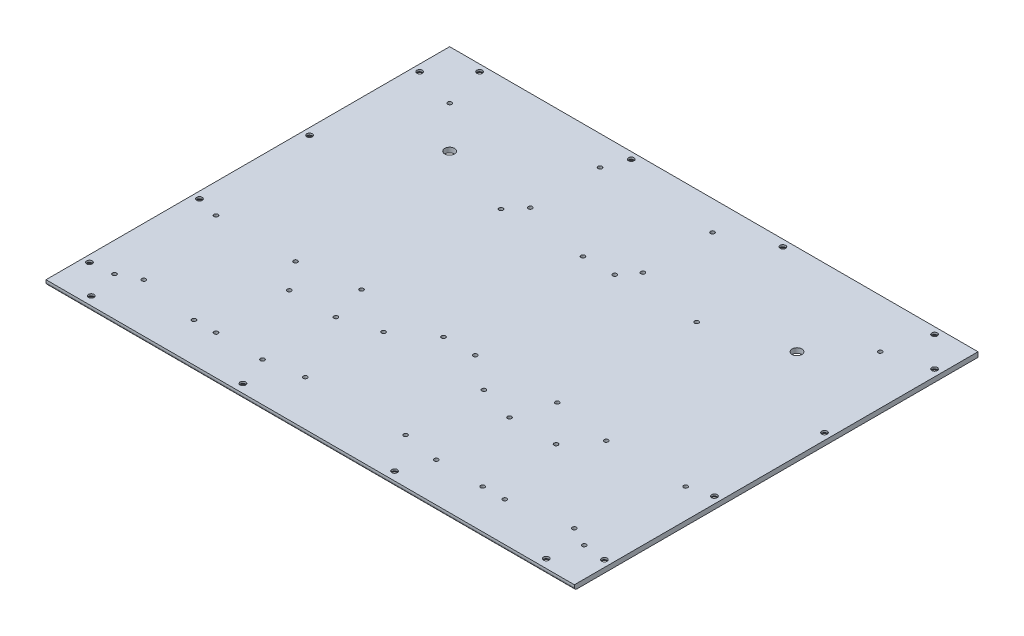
from build123d import *

# Parameters (mm, degrees)
SKETCH_2_W                   = 432
SKETCH_2_H                   = 330
EXTRUDE_1_DEPTH              = 4
HOLE_WIZARD_406_AT_2_COUNT   = 2
HOLE_WIZARD_406_AT_2_PITCH   = 294.02253315
HOLE_WIZARD_406_AT_3_COUNT   = 2
HOLE_WIZARD_406_AT_3_PITCH   = 204.473103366
HOLE_WIZARD_406_AT_4_COUNT   = 2
HOLE_WIZARD_406_AT_4_PITCH   = 115.625472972
HOLE_WIZARD_406_AT_5_COUNT   = 2
HOLE_WIZARD_406_AT_5_PITCH   = 33.604315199
HOLE_WIZARD_406_AT_6_COUNT   = 2
HOLE_WIZARD_406_AT_6_PITCH   = 124
HOLE_WIZARD_406_AT_7_COUNT   = 2
HOLE_WIZARD_406_AT_7_PITCH   = 248
HOLE_WIZARD_406_AT_8_COUNT   = 2
HOLE_WIZARD_406_AT_8_PITCH   = 372
HOLE_WIZARD_406_AT_9_COUNT   = 2
HOLE_WIZARD_406_AT_9_PITCH   = 397.166526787
HOLE_WIZARD_406_AT_10_COUNT  = 2
HOLE_WIZARD_406_AT_10_PITCH  = 412.28782422
HOLE_WIZARD_406_AT_11_COUNT  = 2
HOLE_WIZARD_406_AT_11_PITCH  = 445.445002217
HOLE_WIZARD_406_AT_12_COUNT  = 2
HOLE_WIZARD_406_AT_12_PITCH  = 493.012423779
HOLE_WIZARD_406_AT_13_COUNT  = 2
HOLE_WIZARD_406_AT_13_PITCH  = 489.070802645
HOLE_WIZARD_406_AT_14_COUNT  = 2
HOLE_WIZARD_406_AT_14_PITCH  = 402.87746276
HOLE_WIZARD_406_AT_15_COUNT  = 2
HOLE_WIZARD_406_AT_15_PITCH  = 340.855174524
HOLE_WIZARD_406_AT_16_COUNT  = 2
HOLE_WIZARD_406_AT_16_PITCH  = 317.5
FILLET_1_R                   = 2
HOLE_WIZARD_1584_D           = 8
M4P8_D                       = 3.3
HOLE_WIZARD_3528_D           = 3.3
HOLE_WIZARD_3528_CSINK_D     = 4.05
HOLE_WIZARD_3528_CSINK_ANGLE = 90
M4P9_D                       = 3.3
M4P10_D                      = 3.3


with BuildPart() as part:
    # Sketch 2 → Extrude 1 (new body)
    with BuildSketch(Plane(origin=(0, 0, 0), x_dir=(1, 0, 0), z_dir=(0, 1, 0))):
        with Locations((216, 165)):
            Rectangle(SKETCH_2_W, SKETCH_2_H)
    extrude(amount=EXTRUDE_1_DEPTH)

    # Sketch 3 → Hole Wizard 406 (revolve, cut)
    with BuildSketch(Plane(origin=(30, 0, -7), x_dir=(0, 0, -1), z_dir=(1, 0, 0))):
        Polygon((0, 0), (0, 4), (2.25, 4), (2.25, 2.45), (4.7, 0), align=None)
    hole_wizard_406 = revolve(axis=Axis((30, -6.35, -7), (0, 1, 0)), mode=Mode.SUBTRACT)

    # Hole Wizard 406 at 2: Hole Wizard 406 ×2
    with Locations(*[Vector(-0.0833269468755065, 0, -0.9965222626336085) * (i * HOLE_WIZARD_406_AT_2_PITCH) for i in range(1, HOLE_WIZARD_406_AT_2_COUNT)]):
        add(hole_wizard_406, mode=Mode.SUBTRACT)

    # Hole Wizard 406 at 3: Hole Wizard 406 ×2
    with Locations(*[Vector(-0.11982016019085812, 0, -0.9927956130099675) * (i * HOLE_WIZARD_406_AT_3_PITCH) for i in range(1, HOLE_WIZARD_406_AT_3_COUNT)]):
        add(hole_wizard_406, mode=Mode.SUBTRACT)

    # Hole Wizard 406 at 4: Hole Wizard 406 ×2
    with Locations(*[Vector(-0.21189102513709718, 0, -0.977293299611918) * (i * HOLE_WIZARD_406_AT_4_PITCH) for i in range(1, HOLE_WIZARD_406_AT_4_COUNT)]):
        add(hole_wizard_406, mode=Mode.SUBTRACT)

    # Hole Wizard 406 at 5: Hole Wizard 406 ×2
    with Locations(*[Vector(-0.7290730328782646, 0, -0.6844359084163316) * (i * HOLE_WIZARD_406_AT_5_PITCH) for i in range(1, HOLE_WIZARD_406_AT_5_COUNT)]):
        add(hole_wizard_406, mode=Mode.SUBTRACT)

    # Hole Wizard 406 at 6: Hole Wizard 406 ×2
    with Locations(*[(i * HOLE_WIZARD_406_AT_6_PITCH, 0, 0) for i in range(1, HOLE_WIZARD_406_AT_6_COUNT)]):
        add(hole_wizard_406, mode=Mode.SUBTRACT)

    # Hole Wizard 406 at 7: Hole Wizard 406 ×2
    with Locations(*[(i * HOLE_WIZARD_406_AT_7_PITCH, 0, 0) for i in range(1, HOLE_WIZARD_406_AT_7_COUNT)]):
        add(hole_wizard_406, mode=Mode.SUBTRACT)

    # Hole Wizard 406 at 8: Hole Wizard 406 ×2
    with Locations(*[(i * HOLE_WIZARD_406_AT_8_PITCH, 0, 0) for i in range(1, HOLE_WIZARD_406_AT_8_COUNT)]):
        add(hole_wizard_406, mode=Mode.SUBTRACT)

    # Hole Wizard 406 at 9: Hole Wizard 406 ×2
    with Locations(*[Vector(0.9983217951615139, 0, -0.05791021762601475) * (i * HOLE_WIZARD_406_AT_9_PITCH) for i in range(1, HOLE_WIZARD_406_AT_9_COUNT)]):
        add(hole_wizard_406, mode=Mode.SUBTRACT)

    # Hole Wizard 406 at 10: Hole Wizard 406 ×2
    with Locations(*[Vector(0.9617067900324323, 0, -0.27408037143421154) * (i * HOLE_WIZARD_406_AT_10_PITCH) for i in range(1, HOLE_WIZARD_406_AT_10_COUNT)]):
        add(hole_wizard_406, mode=Mode.SUBTRACT)

    # Hole Wizard 406 at 11: Hole Wizard 406 ×2
    with Locations(*[Vector(0.8901211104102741, 0, -0.45572404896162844) * (i * HOLE_WIZARD_406_AT_11_PITCH) for i in range(1, HOLE_WIZARD_406_AT_11_COUNT)]):
        add(hole_wizard_406, mode=Mode.SUBTRACT)

    # Hole Wizard 406 at 12: Hole Wizard 406 ×2
    with Locations(*[Vector(0.8042393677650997, 0, -0.5943055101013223) * (i * HOLE_WIZARD_406_AT_12_PITCH) for i in range(1, HOLE_WIZARD_406_AT_12_COUNT)]):
        add(hole_wizard_406, mode=Mode.SUBTRACT)

    # Hole Wizard 406 at 13: Hole Wizard 406 ×2
    with Locations(*[Vector(0.760626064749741, 0, -0.649190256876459) * (i * HOLE_WIZARD_406_AT_13_PITCH) for i in range(1, HOLE_WIZARD_406_AT_13_COUNT)]):
        add(hole_wizard_406, mode=Mode.SUBTRACT)

    # Hole Wizard 406 at 14: Hole Wizard 406 ×2
    with Locations(*[Vector(0.6155717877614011, 0, -0.7880808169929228) * (i * HOLE_WIZARD_406_AT_14_PITCH) for i in range(1, HOLE_WIZARD_406_AT_14_COUNT)]):
        add(hole_wizard_406, mode=Mode.SUBTRACT)

    # Hole Wizard 406 at 15: Hole Wizard 406 ×2
    with Locations(*[Vector(0.3637908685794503, 0, -0.9314806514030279) * (i * HOLE_WIZARD_406_AT_15_PITCH) for i in range(1, HOLE_WIZARD_406_AT_15_COUNT)]):
        add(hole_wizard_406, mode=Mode.SUBTRACT)

    # Hole Wizard 406 at 16: Hole Wizard 406 ×2
    with Locations(*[(0, 0, -i * HOLE_WIZARD_406_AT_16_PITCH) for i in range(1, HOLE_WIZARD_406_AT_16_COUNT)]):
        add(hole_wizard_406, mode=Mode.SUBTRACT)

    # Fillet 1
    fillet_1_edges = [part.edges().sort_by_distance(p)[0] for p in [
        (216, 0, 0),
    ]]
    fillet(fillet_1_edges, radius=FILLET_1_R)

    # Hole Wizard 1584 (through all)
    with Locations(Plane(origin=(0, 0, 0), x_dir=(-1, 0, 0), z_dir=(0, -1, 0))):
        with Locations((-74, 256), (-358, 256)):
            Hole(HOLE_WIZARD_1584_D / 2)

    # M4P8 (through all)
    with Locations(Plane(origin=(0, 0, 0), x_dir=(-1, 0, 0), z_dir=(0, -1, 0))):
        with Locations((-107, 32), (-107, 92), (-145, 32), (-145, 92), (-287, 32), (-287, 92), (-325, 32), (-325, 92), (-147, 249), (-239, 249), (-147, 306), (-239, 306)):
            Hole(M4P8_D / 2)

    # Hole Wizard 3528 (through all)
    with Locations(Plane(origin=(0, 0, 0), x_dir=(-1, 0, 0), z_dir=(0, -1, 0))):
        with Locations((-40, 40), (-40, 290), (-392, 290), (-392, 40)):
            CounterSinkHole(HOLE_WIZARD_3528_D / 2, HOLE_WIZARD_3528_CSINK_D / 2, counter_sink_angle=HOLE_WIZARD_3528_CSINK_ANGLE)

    # M4P9 (through all)
    with Locations(Plane(origin=(0, 0, 0), x_dir=(-1, 0, 0), z_dir=(0, -1, 0))):
        with Locations((-24, 32), (-89, 32), (-24, 115), (-89, 115), (-136, 122), (-136, 236), (-203, 122), (-203, 236), (-229, 122), (-229, 236), (-296, 122), (-296, 236), (-343, 32), (-408, 32), (-408, 115), (-343, 115)):
            Hole(M4P9_D / 2)

    # M4P10 (through all)
    with Locations(Plane(origin=(0, 0, 0), x_dir=(-1, 0, 0), z_dir=(0, -1, 0))):
        with Locations((-175, 37), (-257, 37), (-257, 101), (-175, 101)):
            Hole(M4P10_D / 2)


solid = part.part
